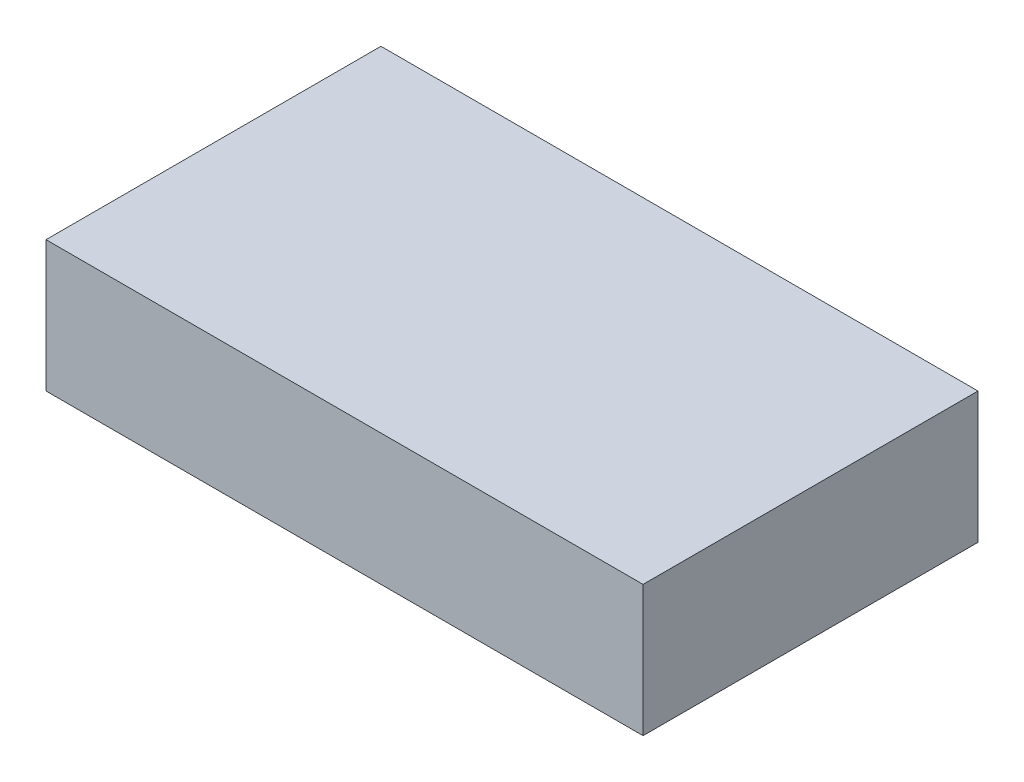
from build123d import *

# Parameters (mm, degrees)
SKETCH1_W           = 82
SKETCH1_H           = 46
BOSS_EXTRUDE1_DEPTH = 18


with BuildPart() as part:
    # Sketch1 → Boss-Extrude1 (new body)
    with BuildSketch(Plane(origin=(0, 0, 0), x_dir=(1, 0, 0), z_dir=(0, 1, 0))):
        Rectangle(SKETCH1_W, SKETCH1_H)
    extrude(amount=BOSS_EXTRUDE1_DEPTH)


solid = part.part
